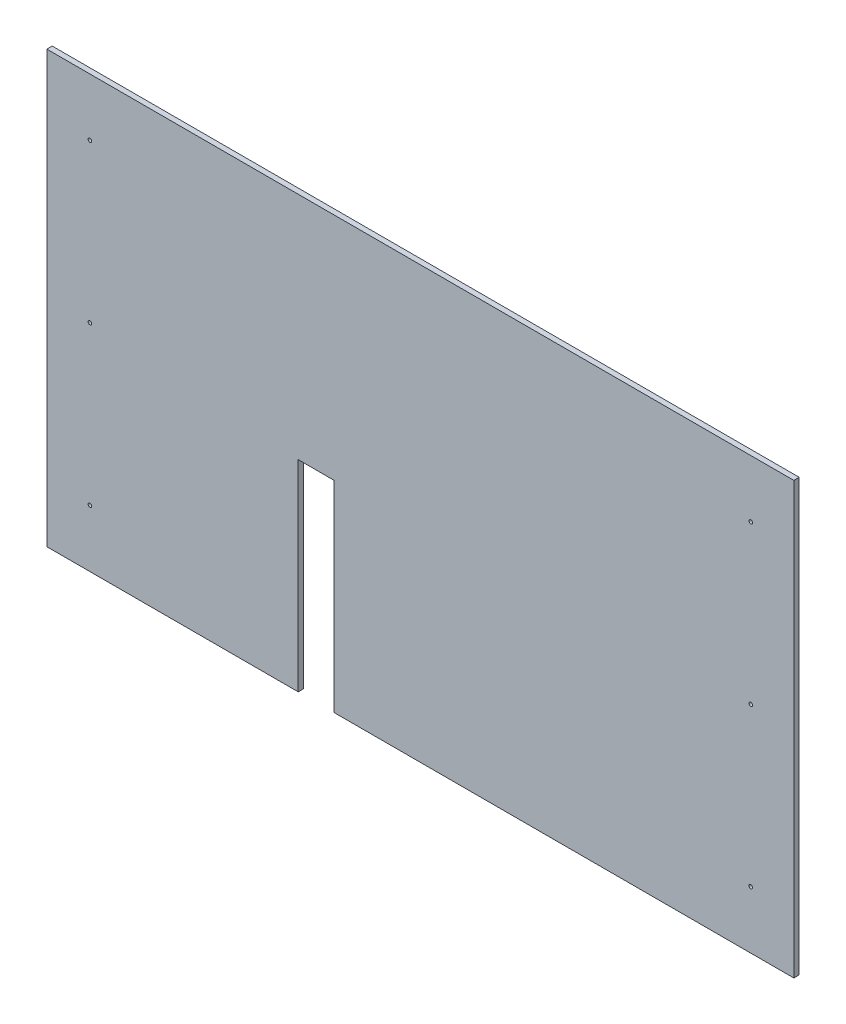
from build123d import *

# Parameters (mm, degrees)
SKETCH1_W                      = 330.2
SKETCH1_H                      = 190.5
BOSS_EXTRUDE1_DEPTH            = 2.3622
SKETCH13_W                     = 15.875
SKETCH13_H                     = 88.9
CUT_EXTRUDE1_DEPTH             = 382.218926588
F_1_16_0_0625_DIAMETER_HOLE1_D = 1.5875


with BuildPart() as part:
    # Sketch1 → Boss-Extrude1 (new body)
    with BuildSketch(Plane.XY):
        with Locations((165.1, -95.25)):
            Rectangle(SKETCH1_W, SKETCH1_H)
    extrude(amount=BOSS_EXTRUDE1_DEPTH)

    # Sketch13 → Cut-Extrude1 (cut, through all)
    with BuildSketch(Plane(origin=(0, 0, 0), x_dir=(-1, 0, 0), z_dir=(0, 0, -1))):
        with Locations((-119.0625, -146.05)):
            Rectangle(SKETCH13_W, SKETCH13_H)
    extrude(amount=-CUT_EXTRUDE1_DEPTH, mode=Mode.SUBTRACT)

    # 1_16 _0.0625_ Diameter Hole1 (through all)
    with Locations(Plane.XY.offset(2.3622)):
        with Locations((19.05, -25.4), (19.05, -95.25), (19.05, -165.1), (311.15, -25.4), (311.15, -95.25), (311.15, -165.1)):
            Hole(F_1_16_0_0625_DIAMETER_HOLE1_D / 2)


solid = part.part
